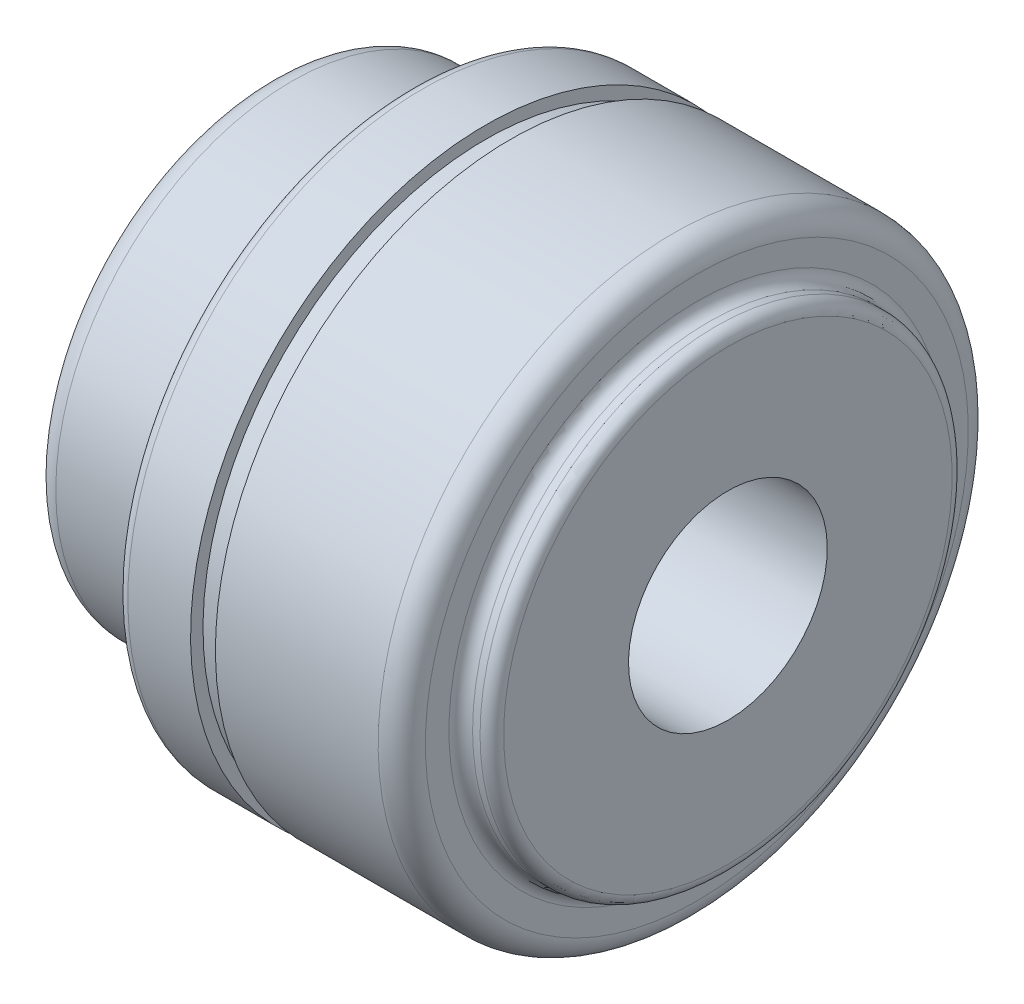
ISO-10303-21;
HEADER;
FILE_DESCRIPTION(('STEP AP214'),'2;1');
FILE_NAME('part.step','',(''),(''),'','','');
FILE_SCHEMA(('AUTOMOTIVE_DESIGN { 1 0 10303 214 1 1 1 1 }'));
ENDSEC;
DATA;
#1=APPLICATION_CONTEXT('core data for automotive mechanical design processes');
#2=APPLICATION_PROTOCOL_DEFINITION('international standard','automotive_design',2000,#1);
#3=PRODUCT_CONTEXT('',#1,'mechanical');
#4=PRODUCT('Part','Part','',(#3));
#5=PRODUCT_RELATED_PRODUCT_CATEGORY('part','',(#4));
#6=PRODUCT_DEFINITION_FORMATION('','',#4);
#7=PRODUCT_DEFINITION_CONTEXT('part definition',#1,'design');
#8=PRODUCT_DEFINITION('design','',#6,#7);
#9=PRODUCT_DEFINITION_SHAPE('','',#8);
#10=(LENGTH_UNIT() NAMED_UNIT(*) SI_UNIT(.MILLI.,.METRE.));
#11=(NAMED_UNIT(*) PLANE_ANGLE_UNIT() SI_UNIT($,.RADIAN.));
#12=(NAMED_UNIT(*) SI_UNIT($,.STERADIAN.) SOLID_ANGLE_UNIT());
#13=UNCERTAINTY_MEASURE_WITH_UNIT(LENGTH_MEASURE(1.E-05),#10,'distance_accuracy_value','');
#14=(GEOMETRIC_REPRESENTATION_CONTEXT(3) GLOBAL_UNCERTAINTY_ASSIGNED_CONTEXT((#13)) GLOBAL_UNIT_ASSIGNED_CONTEXT((#10,
#11,#12)) REPRESENTATION_CONTEXT('',''));
#15=CARTESIAN_POINT('',(0.,0.,0.));
#16=DIRECTION('',(0.,0.,1.));
#17=DIRECTION('',(1.,0.,0.));
#18=AXIS2_PLACEMENT_3D('',#15,#16,#17);
#19=CARTESIAN_POINT('',(3.80000000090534,0.,0.));
#20=DIRECTION('',(-1.,0.,0.));
#21=DIRECTION('',(0.,1.,0.));
#22=AXIS2_PLACEMENT_3D('',#19,#20,#21);
#23=TOROIDAL_SURFACE('',#22,34.1999999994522,3.80000000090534);
#24=CARTESIAN_POINT('',(3.80000000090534,0.,0.));
#25=DIRECTION('',(-1.,0.,0.));
#26=DIRECTION('',(0.,-1.,0.));
#27=AXIS2_PLACEMENT_3D('',#24,#25,#26);
#28=CIRCLE('',#27,38.0000000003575);
#29=CARTESIAN_POINT('',(3.80000000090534,-38.0000000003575,0.));
#30=VERTEX_POINT('',#29);
#31=EDGE_CURVE('E79',#30,#30,#28,.F.);
#32=ORIENTED_EDGE('',*,*,#31,.F.);
#33=EDGE_LOOP('',(#32));
#34=FACE_BOUND('',#33,.T.);
#35=CARTESIAN_POINT('',(0.,0.,0.));
#36=DIRECTION('',(1.,0.,0.));
#37=DIRECTION('',(0.,1.,0.));
#38=AXIS2_PLACEMENT_3D('',#35,#36,#37);
#39=CIRCLE('',#38,34.1999999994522);
#40=CARTESIAN_POINT('',(0.,-34.1999999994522,0.));
#41=VERTEX_POINT('',#40);
#42=CARTESIAN_POINT('',(0.,34.1999999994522,0.));
#43=VERTEX_POINT('',#42);
#44=EDGE_CURVE('E72',#41,#43,#39,.F.);
#45=ORIENTED_EDGE('',*,*,#44,.F.);
#46=CARTESIAN_POINT('',(0.,0.,0.));
#47=DIRECTION('',(1.,0.,0.));
#48=DIRECTION('',(0.,-1.,0.));
#49=AXIS2_PLACEMENT_3D('',#46,#47,#48);
#50=CIRCLE('',#49,34.1999999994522);
#51=EDGE_CURVE('E70',#43,#41,#50,.F.);
#52=ORIENTED_EDGE('',*,*,#51,.F.);
#53=EDGE_LOOP('',(#45,#52));
#54=FACE_BOUND('',#53,.T.);
#55=ADVANCED_FACE('F17',(#34,#54),#23,.T.);
#56=CARTESIAN_POINT('',(0.,0.,0.));
#57=DIRECTION('',(-1.,0.,0.));
#58=DIRECTION('',(0.,-1.,0.));
#59=AXIS2_PLACEMENT_3D('',#56,#57,#58);
#60=PLANE('',#59);
#61=CARTESIAN_POINT('',(0.,0.,0.));
#62=DIRECTION('',(-1.,0.,0.));
#63=DIRECTION('',(0.,-1.,0.));
#64=AXIS2_PLACEMENT_3D('',#61,#62,#63);
#65=CIRCLE('',#64,16.);
#66=CARTESIAN_POINT('',(0.,-16.,0.));
#67=VERTEX_POINT('',#66);
#68=EDGE_CURVE('E137',#67,#67,#65,.F.);
#69=ORIENTED_EDGE('',*,*,#68,.T.);
#70=EDGE_LOOP('',(#69));
#71=FACE_BOUND('',#70,.T.);
#72=ORIENTED_EDGE('',*,*,#44,.T.);
#73=ORIENTED_EDGE('',*,*,#51,.T.);
#74=EDGE_LOOP('',(#72,#73));
#75=FACE_BOUND('',#74,.T.);
#76=ADVANCED_FACE('F78',(#71,#75),#60,.T.);
#77=CARTESIAN_POINT('',(77.6999999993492,0.,0.));
#78=DIRECTION('',(-1.,0.,0.));
#79=DIRECTION('',(0.,-1.,0.));
#80=AXIS2_PLACEMENT_3D('',#77,#78,#79);
#81=CYLINDRICAL_SURFACE('',#80,38.0000000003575);
#82=CARTESIAN_POINT('',(21.1000000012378,0.,0.));
#83=DIRECTION('',(-1.,0.,0.));
#84=DIRECTION('',(0.,1.,0.));
#85=AXIS2_PLACEMENT_3D('',#82,#83,#84);
#86=CIRCLE('',#85,38.0000000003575);
#87=CARTESIAN_POINT('',(21.1000000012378,38.0000000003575,0.));
#88=VERTEX_POINT('',#87);
#89=EDGE_CURVE('E129',#88,#88,#86,.T.);
#90=ORIENTED_EDGE('',*,*,#89,.T.);
#91=EDGE_LOOP('',(#90));
#92=FACE_BOUND('',#91,.T.);
#93=ORIENTED_EDGE('',*,*,#31,.T.);
#94=EDGE_LOOP('',(#93));
#95=FACE_BOUND('',#94,.T.);
#96=ADVANCED_FACE('F95',(#92,#95),#81,.T.);
#97=CARTESIAN_POINT('',(77.6999999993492,0.,0.));
#98=DIRECTION('',(-1.,0.,0.));
#99=DIRECTION('',(0.,-1.,0.));
#100=AXIS2_PLACEMENT_3D('',#97,#98,#99);
#101=CYLINDRICAL_SURFACE('',#100,16.);
#102=ORIENTED_EDGE('',*,*,#68,.F.);
#103=EDGE_LOOP('',(#102));
#104=FACE_BOUND('',#103,.T.);
#105=CARTESIAN_POINT('',(73.9999999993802,0.,0.));
#106=DIRECTION('',(-1.,0.,0.));
#107=DIRECTION('',(0.,-1.,0.));
#108=AXIS2_PLACEMENT_3D('',#105,#106,#107);
#109=CIRCLE('',#108,16.);
#110=CARTESIAN_POINT('',(73.9999999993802,-16.,0.));
#111=VERTEX_POINT('',#110);
#112=EDGE_CURVE('E136',#111,#111,#109,.F.);
#113=ORIENTED_EDGE('',*,*,#112,.T.);
#114=EDGE_LOOP('',(#113));
#115=FACE_BOUND('',#114,.T.);
#116=ADVANCED_FACE('F100',(#104,#115),#101,.F.);
#117=CARTESIAN_POINT('',(21.1000000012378,0.,0.));
#118=DIRECTION('',(-1.,0.,0.));
#119=DIRECTION('',(0.,1.,0.));
#120=AXIS2_PLACEMENT_3D('',#117,#118,#119);
#121=TOROIDAL_SURFACE('',#120,39.8999999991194,1.89999999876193);
#122=CARTESIAN_POINT('',(22.9999999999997,0.,0.));
#123=DIRECTION('',(-1.,0.,0.));
#124=DIRECTION('',(0.,-1.,0.));
#125=AXIS2_PLACEMENT_3D('',#122,#123,#124);
#126=CIRCLE('',#125,39.8999999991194);
#127=CARTESIAN_POINT('',(22.9999999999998,39.8999999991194,0.));
#128=VERTEX_POINT('',#127);
#129=CARTESIAN_POINT('',(22.9999999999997,-39.8999999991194,0.));
#130=VERTEX_POINT('',#129);
#131=EDGE_CURVE('E124',#128,#130,#126,.F.);
#132=ORIENTED_EDGE('',*,*,#131,.F.);
#133=CARTESIAN_POINT('',(22.9999999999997,0.,0.));
#134=DIRECTION('',(-1.,0.,0.));
#135=DIRECTION('',(0.,1.,0.));
#136=AXIS2_PLACEMENT_3D('',#133,#134,#135);
#137=CIRCLE('',#136,39.8999999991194);
#138=EDGE_CURVE('E140',#130,#128,#137,.F.);
#139=ORIENTED_EDGE('',*,*,#138,.F.);
#140=EDGE_LOOP('',(#132,#139));
#141=FACE_BOUND('',#140,.T.);
#142=ORIENTED_EDGE('',*,*,#89,.F.);
#143=EDGE_LOOP('',(#142));
#144=FACE_BOUND('',#143,.T.);
#145=ADVANCED_FACE('F104',(#141,#144),#121,.F.);
#146=CARTESIAN_POINT('',(73.9999999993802,0.,0.));
#147=DIRECTION('',(-1.,0.,0.));
#148=DIRECTION('',(0.,-1.,0.));
#149=AXIS2_PLACEMENT_3D('',#146,#147,#148);
#150=PLANE('',#149);
#151=ORIENTED_EDGE('',*,*,#112,.F.);
#152=EDGE_LOOP('',(#151));
#153=FACE_BOUND('',#152,.T.);
#154=CARTESIAN_POINT('',(73.9999999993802,0.,0.));
#155=DIRECTION('',(-1.,0.,0.));
#156=DIRECTION('',(0.,-1.,0.));
#157=AXIS2_PLACEMENT_3D('',#154,#155,#156);
#158=CIRCLE('',#157,36.1000000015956);
#159=CARTESIAN_POINT('',(73.9999999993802,-36.1000000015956,0.));
#160=VERTEX_POINT('',#159);
#161=CARTESIAN_POINT('',(73.9999999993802,36.1000000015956,0.));
#162=VERTEX_POINT('',#161);
#163=EDGE_CURVE('E335',#160,#162,#158,.T.);
#164=ORIENTED_EDGE('',*,*,#163,.F.);
#165=CARTESIAN_POINT('',(73.9999999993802,0.,0.));
#166=DIRECTION('',(-1.,0.,0.));
#167=DIRECTION('',(0.,1.,0.));
#168=AXIS2_PLACEMENT_3D('',#165,#166,#167);
#169=CIRCLE('',#168,36.1000000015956);
#170=EDGE_CURVE('E345',#162,#160,#169,.T.);
#171=ORIENTED_EDGE('',*,*,#170,.F.);
#172=EDGE_LOOP('',(#164,#171));
#173=FACE_BOUND('',#172,.T.);
#174=ADVANCED_FACE('F110',(#153,#173),#150,.F.);
#175=CARTESIAN_POINT('',(22.9999999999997,0.,0.));
#176=DIRECTION('',(-1.,0.,0.));
#177=DIRECTION('',(0.,-1.,0.));
#178=AXIS2_PLACEMENT_3D('',#175,#176,#177);
#179=PLANE('',#178);
#180=ORIENTED_EDGE('',*,*,#138,.T.);
#181=ORIENTED_EDGE('',*,*,#131,.T.);
#182=EDGE_LOOP('',(#180,#181));
#183=FACE_BOUND('',#182,.T.);
#184=CARTESIAN_POINT('',(22.9999999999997,0.,0.));
#185=DIRECTION('',(1.,0.,0.));
#186=DIRECTION('',(0.,1.,0.));
#187=AXIS2_PLACEMENT_3D('',#184,#185,#186);
#188=CIRCLE('',#187,45.6000000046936);
#189=CARTESIAN_POINT('',(22.9999999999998,45.6000000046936,0.));
#190=VERTEX_POINT('',#189);
#191=CARTESIAN_POINT('',(22.9999999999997,-45.6000000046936,0.));
#192=VERTEX_POINT('',#191);
#193=EDGE_CURVE('E253',#190,#192,#188,.T.);
#194=ORIENTED_EDGE('',*,*,#193,.F.);
#195=CARTESIAN_POINT('',(22.9999999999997,0.,0.));
#196=DIRECTION('',(1.,0.,0.));
#197=DIRECTION('',(0.,-1.,0.));
#198=AXIS2_PLACEMENT_3D('',#195,#196,#197);
#199=CIRCLE('',#198,45.6000000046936);
#200=EDGE_CURVE('E281',#192,#190,#199,.T.);
#201=ORIENTED_EDGE('',*,*,#200,.F.);
#202=EDGE_LOOP('',(#194,#201));
#203=FACE_BOUND('',#202,.T.);
#204=ADVANCED_FACE('F290',(#183,#203),#179,.T.);
#205=CARTESIAN_POINT('',(72.1000000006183,0.,0.));
#206=DIRECTION('',(-1.,0.,0.));
#207=DIRECTION('',(0.,1.,0.));
#208=AXIS2_PLACEMENT_3D('',#205,#206,#207);
#209=TOROIDAL_SURFACE('',#208,36.1000000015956,1.89999999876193);
#210=ORIENTED_EDGE('',*,*,#170,.T.);
#211=ORIENTED_EDGE('',*,*,#163,.T.);
#212=EDGE_LOOP('',(#210,#211));
#213=FACE_BOUND('',#212,.T.);
#214=CARTESIAN_POINT('',(72.1000000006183,0.,0.));
#215=DIRECTION('',(-1.,0.,0.));
#216=DIRECTION('',(0.,-1.,0.));
#217=AXIS2_PLACEMENT_3D('',#214,#215,#216);
#218=CIRCLE('',#217,38.0000000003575);
#219=CARTESIAN_POINT('',(72.1000000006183,-38.0000000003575,0.));
#220=VERTEX_POINT('',#219);
#221=EDGE_CURVE('E279',#220,#220,#218,.T.);
#222=ORIENTED_EDGE('',*,*,#221,.F.);
#223=EDGE_LOOP('',(#222));
#224=FACE_BOUND('',#223,.T.);
#225=ADVANCED_FACE('F270',(#213,#224),#209,.T.);
#226=CARTESIAN_POINT('',(24.8999999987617,0.,0.));
#227=DIRECTION('',(-1.,0.,0.));
#228=DIRECTION('',(0.,1.,0.));
#229=AXIS2_PLACEMENT_3D('',#226,#227,#228);
#230=TOROIDAL_SURFACE('',#229,45.6000000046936,1.89999999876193);
#231=ORIENTED_EDGE('',*,*,#193,.T.);
#232=ORIENTED_EDGE('',*,*,#200,.T.);
#233=EDGE_LOOP('',(#231,#232));
#234=FACE_BOUND('',#233,.T.);
#235=CARTESIAN_POINT('',(24.8999999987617,0.,0.));
#236=DIRECTION('',(-1.,0.,0.));
#237=DIRECTION('',(0.,-1.,0.));
#238=AXIS2_PLACEMENT_3D('',#235,#236,#237);
#239=CIRCLE('',#238,47.5000000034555);
#240=CARTESIAN_POINT('',(24.8999999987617,-47.5000000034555,0.));
#241=VERTEX_POINT('',#240);
#242=EDGE_CURVE('E278',#241,#241,#239,.F.);
#243=ORIENTED_EDGE('',*,*,#242,.F.);
#244=EDGE_LOOP('',(#243));
#245=FACE_BOUND('',#244,.T.);
#246=ADVANCED_FACE('F260',(#234,#245),#230,.T.);
#247=CARTESIAN_POINT('',(77.6999999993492,0.,0.));
#248=DIRECTION('',(-1.,0.,0.));
#249=DIRECTION('',(0.,-1.,0.));
#250=AXIS2_PLACEMENT_3D('',#247,#248,#249);
#251=CYLINDRICAL_SURFACE('',#250,38.0000000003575);
#252=ORIENTED_EDGE('',*,*,#221,.T.);
#253=EDGE_LOOP('',(#252));
#254=FACE_BOUND('',#253,.T.);
#255=CARTESIAN_POINT('',(70.8999999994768,0.,0.));
#256=DIRECTION('',(-1.,0.,0.));
#257=DIRECTION('',(0.,1.,0.));
#258=AXIS2_PLACEMENT_3D('',#255,#256,#257);
#259=CIRCLE('',#258,38.0000000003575);
#260=CARTESIAN_POINT('',(70.8999999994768,38.0000000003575,0.));
#261=VERTEX_POINT('',#260);
#262=EDGE_CURVE('E379',#261,#261,#259,.F.);
#263=ORIENTED_EDGE('',*,*,#262,.T.);
#264=EDGE_LOOP('',(#263));
#265=FACE_BOUND('',#264,.T.);
#266=ADVANCED_FACE('F269',(#254,#265),#251,.T.);
#267=CARTESIAN_POINT('',(77.6999999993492,0.,0.));
#268=DIRECTION('',(-1.,0.,0.));
#269=DIRECTION('',(0.,-1.,0.));
#270=AXIS2_PLACEMENT_3D('',#267,#268,#269);
#271=CYLINDRICAL_SURFACE('',#270,47.5000000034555);
#272=ORIENTED_EDGE('',*,*,#242,.T.);
#273=EDGE_LOOP('',(#272));
#274=FACE_BOUND('',#273,.T.);
#275=CARTESIAN_POINT('',(35.,0.,0.));
#276=DIRECTION('',(-1.,0.,0.));
#277=DIRECTION('',(0.,-1.,0.));
#278=AXIS2_PLACEMENT_3D('',#275,#276,#277);
#279=CIRCLE('',#278,47.5000000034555);
#280=CARTESIAN_POINT('',(35.,-47.5000000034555,0.));
#281=VERTEX_POINT('',#280);
#282=EDGE_CURVE('E380',#281,#281,#279,.T.);
#283=ORIENTED_EDGE('',*,*,#282,.T.);
#284=EDGE_LOOP('',(#283));
#285=FACE_BOUND('',#284,.T.);
#286=ADVANCED_FACE('F235',(#274,#285),#271,.T.);
#287=CARTESIAN_POINT('',(70.8999999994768,0.,0.));
#288=DIRECTION('',(-1.,0.,0.));
#289=DIRECTION('',(0.,1.,0.));
#290=AXIS2_PLACEMENT_3D('',#287,#288,#289);
#291=TOROIDAL_SURFACE('',#290,39.8999999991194,1.89999999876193);
#292=ORIENTED_EDGE('',*,*,#262,.F.);
#293=EDGE_LOOP('',(#292));
#294=FACE_BOUND('',#293,.T.);
#295=CARTESIAN_POINT('',(69.0000000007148,0.,0.));
#296=DIRECTION('',(1.,0.,0.));
#297=DIRECTION('',(0.,1.,0.));
#298=AXIS2_PLACEMENT_3D('',#295,#296,#297);
#299=CIRCLE('',#298,39.8999999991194);
#300=CARTESIAN_POINT('',(69.0000000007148,39.8999999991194,0.));
#301=VERTEX_POINT('',#300);
#302=CARTESIAN_POINT('',(69.0000000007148,-39.8999999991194,0.));
#303=VERTEX_POINT('',#302);
#304=EDGE_CURVE('E210',#301,#303,#299,.T.);
#305=ORIENTED_EDGE('',*,*,#304,.T.);
#306=CARTESIAN_POINT('',(69.0000000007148,0.,0.));
#307=DIRECTION('',(1.,0.,0.));
#308=DIRECTION('',(0.,-1.,0.));
#309=AXIS2_PLACEMENT_3D('',#306,#307,#308);
#310=CIRCLE('',#309,39.8999999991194);
#311=EDGE_CURVE('E382',#303,#301,#310,.T.);
#312=ORIENTED_EDGE('',*,*,#311,.T.);
#313=EDGE_LOOP('',(#305,#312));
#314=FACE_BOUND('',#313,.T.);
#315=ADVANCED_FACE('F231',(#294,#314),#291,.F.);
#316=CARTESIAN_POINT('',(35.,0.,0.));
#317=DIRECTION('',(-1.,0.,0.));
#318=DIRECTION('',(0.,-1.,0.));
#319=AXIS2_PLACEMENT_3D('',#316,#317,#318);
#320=PLANE('',#319);
#321=CARTESIAN_POINT('',(35.,0.,0.));
#322=DIRECTION('',(-1.,0.,0.));
#323=DIRECTION('',(0.,-1.,0.));
#324=AXIS2_PLACEMENT_3D('',#321,#322,#323);
#325=CIRCLE('',#324,45.5);
#326=CARTESIAN_POINT('',(35.,-45.5,0.));
#327=VERTEX_POINT('',#326);
#328=EDGE_CURVE('E413',#327,#327,#325,.F.);
#329=ORIENTED_EDGE('',*,*,#328,.F.);
#330=EDGE_LOOP('',(#329));
#331=FACE_BOUND('',#330,.T.);
#332=ORIENTED_EDGE('',*,*,#282,.F.);
#333=EDGE_LOOP('',(#332));
#334=FACE_BOUND('',#333,.T.);
#335=ADVANCED_FACE('F189',(#331,#334),#320,.F.);
#336=CARTESIAN_POINT('',(69.0000000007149,0.,0.));
#337=DIRECTION('',(-1.,0.,0.));
#338=DIRECTION('',(0.,-1.,0.));
#339=AXIS2_PLACEMENT_3D('',#336,#337,#338);
#340=PLANE('',#339);
#341=ORIENTED_EDGE('',*,*,#311,.F.);
#342=ORIENTED_EDGE('',*,*,#304,.F.);
#343=EDGE_LOOP('',(#341,#342));
#344=FACE_BOUND('',#343,.T.);
#345=CARTESIAN_POINT('',(69.0000000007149,0.,0.));
#346=DIRECTION('',(-1.,0.,0.));
#347=DIRECTION('',(0.,-1.,0.));
#348=AXIS2_PLACEMENT_3D('',#345,#346,#347);
#349=CIRCLE('',#348,43.7000000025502);
#350=CARTESIAN_POINT('',(69.0000000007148,-43.7000000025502,0.));
#351=VERTEX_POINT('',#350);
#352=CARTESIAN_POINT('',(69.0000000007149,43.7000000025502,0.));
#353=VERTEX_POINT('',#352);
#354=EDGE_CURVE('E37',#351,#353,#349,.T.);
#355=ORIENTED_EDGE('',*,*,#354,.F.);
#356=CARTESIAN_POINT('',(69.0000000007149,0.,0.));
#357=DIRECTION('',(-1.,0.,0.));
#358=DIRECTION('',(0.,1.,0.));
#359=AXIS2_PLACEMENT_3D('',#356,#357,#358);
#360=CIRCLE('',#359,43.7000000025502);
#361=EDGE_CURVE('E219',#353,#351,#360,.T.);
#362=ORIENTED_EDGE('',*,*,#361,.F.);
#363=EDGE_LOOP('',(#355,#362));
#364=FACE_BOUND('',#363,.T.);
#365=ADVANCED_FACE('F180',(#344,#364),#340,.F.);
#366=CARTESIAN_POINT('',(77.6999999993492,0.,0.));
#367=DIRECTION('',(-1.,0.,0.));
#368=DIRECTION('',(0.,-1.,0.));
#369=AXIS2_PLACEMENT_3D('',#366,#367,#368);
#370=CYLINDRICAL_SURFACE('',#369,45.5);
#371=CARTESIAN_POINT('',(39.,0.,0.));
#372=DIRECTION('',(-1.,0.,0.));
#373=DIRECTION('',(0.,-1.,0.));
#374=AXIS2_PLACEMENT_3D('',#371,#372,#373);
#375=CIRCLE('',#374,45.5);
#376=CARTESIAN_POINT('',(39.,-45.5,0.));
#377=VERTEX_POINT('',#376);
#378=EDGE_CURVE('E408',#377,#377,#375,.F.);
#379=ORIENTED_EDGE('',*,*,#378,.F.);
#380=EDGE_LOOP('',(#379));
#381=FACE_BOUND('',#380,.T.);
#382=ORIENTED_EDGE('',*,*,#328,.T.);
#383=EDGE_LOOP('',(#382));
#384=FACE_BOUND('',#383,.T.);
#385=ADVANCED_FACE('F167',(#381,#384),#370,.T.);
#386=CARTESIAN_POINT('',(65.1999999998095,0.,0.));
#387=DIRECTION('',(-1.,0.,0.));
#388=DIRECTION('',(0.,1.,0.));
#389=AXIS2_PLACEMENT_3D('',#386,#387,#388);
#390=TOROIDAL_SURFACE('',#389,43.7000000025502,3.80000000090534);
#391=CARTESIAN_POINT('',(65.1999999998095,0.,0.));
#392=DIRECTION('',(-1.,0.,0.));
#393=DIRECTION('',(0.,-1.,0.));
#394=AXIS2_PLACEMENT_3D('',#391,#392,#393);
#395=CIRCLE('',#394,47.5000000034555);
#396=CARTESIAN_POINT('',(65.1999999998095,-47.5000000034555,0.));
#397=VERTEX_POINT('',#396);
#398=EDGE_CURVE('E29',#397,#397,#395,.T.);
#399=ORIENTED_EDGE('',*,*,#398,.F.);
#400=EDGE_LOOP('',(#399));
#401=FACE_BOUND('',#400,.T.);
#402=ORIENTED_EDGE('',*,*,#361,.T.);
#403=ORIENTED_EDGE('',*,*,#354,.T.);
#404=EDGE_LOOP('',(#402,#403));
#405=FACE_BOUND('',#404,.T.);
#406=ADVANCED_FACE('F155',(#401,#405),#390,.T.);
#407=CARTESIAN_POINT('',(39.,0.,0.));
#408=DIRECTION('',(-1.,0.,0.));
#409=DIRECTION('',(0.,-1.,0.));
#410=AXIS2_PLACEMENT_3D('',#407,#408,#409);
#411=PLANE('',#410);
#412=ORIENTED_EDGE('',*,*,#378,.T.);
#413=EDGE_LOOP('',(#412));
#414=FACE_BOUND('',#413,.T.);
#415=CARTESIAN_POINT('',(39.,0.,0.));
#416=DIRECTION('',(-1.,0.,0.));
#417=DIRECTION('',(0.,-1.,0.));
#418=AXIS2_PLACEMENT_3D('',#415,#416,#417);
#419=CIRCLE('',#418,47.5000000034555);
#420=CARTESIAN_POINT('',(39.,-47.5000000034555,0.));
#421=VERTEX_POINT('',#420);
#422=EDGE_CURVE('E11',#421,#421,#419,.F.);
#423=ORIENTED_EDGE('',*,*,#422,.F.);
#424=EDGE_LOOP('',(#423));
#425=FACE_BOUND('',#424,.T.);
#426=ADVANCED_FACE('F166',(#414,#425),#411,.T.);
#427=CARTESIAN_POINT('',(77.6999999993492,0.,0.));
#428=DIRECTION('',(-1.,0.,0.));
#429=DIRECTION('',(0.,-1.,0.));
#430=AXIS2_PLACEMENT_3D('',#427,#428,#429);
#431=CYLINDRICAL_SURFACE('',#430,47.5000000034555);
#432=ORIENTED_EDGE('',*,*,#422,.T.);
#433=EDGE_LOOP('',(#432));
#434=FACE_BOUND('',#433,.T.);
#435=ORIENTED_EDGE('',*,*,#398,.T.);
#436=EDGE_LOOP('',(#435));
#437=FACE_BOUND('',#436,.T.);
#438=ADVANCED_FACE('F397',(#434,#437),#431,.T.);
#439=CLOSED_SHELL('',(#55,#76,#96,#116,#145,#174,#204,#225,#246,#266,#286,#315,#335,#365,#385,
#406,#426,#438));
#440=MANIFOLD_SOLID_BREP('B1',#439);
#441=ADVANCED_BREP_SHAPE_REPRESENTATION('',(#18,#440),#14);
#442=SHAPE_DEFINITION_REPRESENTATION(#9,#441);
ENDSEC;
END-ISO-10303-21;
